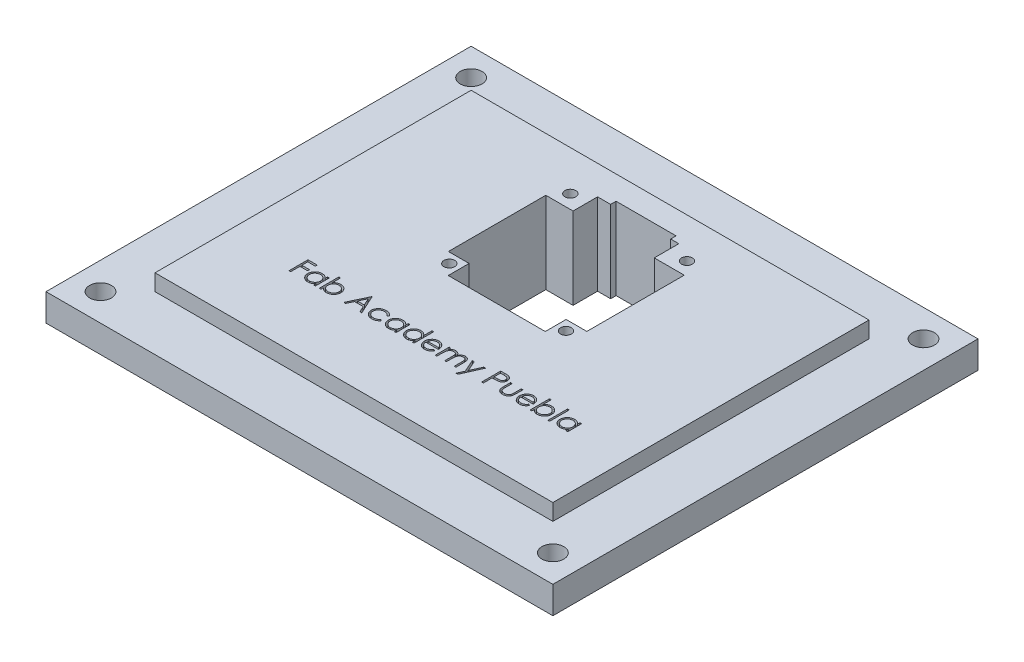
from build123d import *

# Parameters (mm, degrees)
SKETCH2_W           = 73
SKETCH2_H           = 58
SKETCH2_W_2         = 25.4
SKETCH2_H_2         = 26.2
BOSS_EXTRUDE1_DEPTH = 15
SKETCH3_W           = 5
SKETCH3_H           = 4.5
SKETCH3_W_2         = 5.5
SKETCH3_W_3         = 3.8
SKETCH3_H_2         = 3.828755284
BOSS_EXTRUDE2_DEPTH = 15
SKETCH4_R           = 1
SKETCH4_W           = 11
SKETCH4_H           = 1
CUT_EXTRUDE1_DEPTH  = 49.971930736
SKETCH6_W           = 93
SKETCH6_H           = 78
SKETCH6_R           = 2
SKETCH6_W_2         = 73
SKETCH6_H_2         = 58
BOSS_EXTRUDE6_DEPTH = 5
SKETCH7_W           = 0.314102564
SKETCH7_H           = 3.58974359
CUT_EXTRUDE2_DEPTH  = 2


with BuildPart() as part:
    # Sketch2 → Boss-Extrude1 (new body)
    with BuildSketch(Plane(origin=(0, 0, 0), x_dir=(1, 0, 0), z_dir=(0, 1, 0))):
        Rectangle(SKETCH2_W, SKETCH2_H)
        with Locations((-0.26899571, 10.570280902)):
            Rectangle(SKETCH2_W_2, SKETCH2_H_2, mode=Mode.SUBTRACT)
    extrude(amount=BOSS_EXTRUDE1_DEPTH)

    # Sketch3 → Boss-Extrude2 (add)
    with BuildSketch(Plane(origin=(0, 15, 0), x_dir=(1, 0, 0), z_dir=(0, 1, 0))):
        with Locations((-10.46899571, 21.420280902)):
            Rectangle(SKETCH3_W, SKETCH3_H)
        with Locations((9.68100429, 21.420280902)):
            Rectangle(SKETCH3_W_2, SKETCH3_H)
        with Locations((10.53100429, -0.615341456)):
            Rectangle(SKETCH3_W_3, SKETCH3_H_2)
        with Locations((-11.06899571, -0.615341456)):
            Rectangle(SKETCH3_W_3, SKETCH3_H_2)
    extrude(amount=-BOSS_EXTRUDE2_DEPTH)

    # Sketch4 → Cut-Extrude1 (cut, through all)
    with BuildSketch(Plane(origin=(0, 15, 0), x_dir=(1, 0, 0), z_dir=(0, 1, 0))):
        with Locations(Location((-10.96899571, 21.670280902, 0), (0, 0, 270))):
            Circle(SKETCH4_R)
        with Locations(Location((10.43100429, 21.670280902, 0), (0, 0, 270))):
            Circle(SKETCH4_R)
        with Locations(Location((-10.96899571, -0.529719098, 0), (0, 0, 270))):
            Circle(SKETCH4_R)
        with Locations(Location((10.43100429, -0.529719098, 0), (0, 0, 270))):
            Circle(SKETCH4_R)
        with Locations((-0.06899571, 24.170280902)):
            Rectangle(SKETCH4_W, SKETCH4_H)
    extrude(amount=-CUT_EXTRUDE1_DEPTH, mode=Mode.SUBTRACT)

    # Sketch6 → Boss-Extrude6 (add)
    with BuildSketch(Plane(origin=(0, 12, 0), x_dir=(1, 0, 0), z_dir=(0, 1, 0))):
        Rectangle(SKETCH6_W, SKETCH6_H)
        with Locations(Location((41.5, 34, 0), (0, 0, 270))):
            Circle(SKETCH6_R, mode=Mode.SUBTRACT)
        with Locations(Location((41.5, -34, 0), (0, 0, 270))):
            Circle(SKETCH6_R, mode=Mode.SUBTRACT)
        with Locations(Location((-41.5, -34, 0), (0, 0, 270))):
            Circle(SKETCH6_R, mode=Mode.SUBTRACT)
        with Locations(Location((-41.5, 34, 0), (0, 0, 270))):
            Circle(SKETCH6_R, mode=Mode.SUBTRACT)
        Rectangle(SKETCH6_W_2, SKETCH6_H_2, mode=Mode.SUBTRACT)
    extrude(amount=-BOSS_EXTRUDE6_DEPTH)

    # Sketch7 → Cut-Extrude2 (cut)
    # profile 1 of 16: a face of its own
    with BuildSketch(Plane(origin=(0, 15, 0), x_dir=(1, 0, 0), z_dir=(0, 1, 0))):
        Polygon((-24.535377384, -12.892726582), (-22.830249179, -12.892726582), (-22.830249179, -13.251700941), (-24.22127482, -13.251700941), (-24.22127482, -14.328624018), (-22.830249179, -14.328624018), (-22.830249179, -14.687598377), (-24.22127482, -14.687598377), (-24.22127482, -16.392726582), (-24.535377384, -16.392726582), align=None)
    # profile 2 of 16: a face of its own
    with BuildSketch(Plane(origin=(0, 15, 0), x_dir=(1, 0, 0), z_dir=(0, 1, 0))):
        with BuildLine():
            Line((-19.689223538, -13.835034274), (-19.689223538, -16.392726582))
            Line((-19.689223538, -16.392726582), (-20.003326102, -16.392726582))
            Line((-20.003326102, -16.392726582), (-20.003326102, -15.95031873))
            add(Edge.make_bspline(
                [(-20.003326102, -15.95031873), (-20.038744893, -15.990358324), (-20.107865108, -16.068496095), (-20.223306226, -16.170578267), (-20.345674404, -16.254956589), (-20.474375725, -16.323106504), (-20.609293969, -16.374298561), (-20.750130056, -16.41068472), (-20.896941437, -16.434078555), (-20.997193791, -16.436414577), (-21.047997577, -16.437598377)],
                knots=[0, 0, 0, 0, 1.074387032, 2.096679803, 3.090159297, 4.057316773, 5.018401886, 5.985159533, 6.978961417, 8, 8, 8, 8], degree=3))
            add(Edge.make_bspline(
                [(-21.047997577, -16.437598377), (-21.09316553, -16.436372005), (-21.182238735, -16.433953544), (-21.313267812, -16.415191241), (-21.439360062, -16.385060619), (-21.560634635, -16.34315973), (-21.67630678, -16.287578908), (-21.787366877, -16.22103766), (-21.893239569, -16.14179683), (-21.992311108, -16.051208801), (-22.083543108, -15.952813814), (-22.163604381, -15.847868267), (-22.230357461, -15.736825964), (-22.286177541, -15.62109281), (-22.329173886, -15.49977789), (-22.35914752, -15.373300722), (-22.377887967, -15.241810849), (-22.380305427, -15.152271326), (-22.38153123, -15.10686921)],
                knots=[0, 0, 0, 0, 1.033919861, 2.038935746, 3.024066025, 3.998881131, 4.97069526, 5.957263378, 6.95902576, 7.993208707, 9.027059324, 10.027763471, 11.009749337, 11.988697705, 12.965288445, 13.950418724, 14.960734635, 16, 16, 16, 16], degree=3))
            add(Edge.make_bspline(
                [(-22.38153123, -15.10686921), (-22.380278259, -15.062405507), (-22.377801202, -14.974503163), (-22.359347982, -14.845224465), (-22.328316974, -14.720706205), (-22.284769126, -14.601349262), (-22.228927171, -14.487009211), (-22.160999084, -14.377605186), (-22.080979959, -14.272835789), (-21.988727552, -14.175164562), (-21.888792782, -14.084943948), (-21.781884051, -14.006534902), (-21.67066077, -13.938818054), (-21.553397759, -13.885164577), (-21.431830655, -13.841755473), (-21.304877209, -13.811722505), (-21.17306563, -13.794025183), (-21.083575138, -13.791462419), (-21.038181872, -13.79016248)],
                knots=[0, 0, 0, 0, 1.020392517, 2.01726096, 2.990465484, 3.961182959, 4.928053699, 5.906110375, 6.912531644, 7.948652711, 8.985773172, 9.998621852, 10.987621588, 11.969261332, 12.953316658, 13.946091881, 14.958173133, 16, 16, 16, 16], degree=3))
            add(Edge.make_bspline(
                [(-21.038181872, -13.79016248), (-20.985982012, -13.791600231), (-20.883620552, -13.794419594), (-20.733892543, -13.817882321), (-20.592248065, -13.857520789), (-20.457593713, -13.911438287), (-20.330413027, -13.983087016), (-20.211910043, -14.073466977), (-20.10084456, -14.182008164), (-20.036464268, -14.265378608), (-20.003326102, -14.308291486)],
                knots=[0, 0, 0, 0, 1.038897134, 2.037228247, 3.008116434, 3.962042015, 4.918381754, 5.904844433, 6.921570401, 8, 8, 8, 8], degree=3))
            Line((-20.003326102, -14.308291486), (-20.003326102, -13.835034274))
            Line((-20.003326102, -13.835034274), (-19.689223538, -13.835034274))
        make_face()
        with BuildLine():
            add(Edge.make_bspline(
                [(-21.033975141, -14.104265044), (-21.079889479, -14.105898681), (-21.170517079, -14.109123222), (-21.303561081, -14.134296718), (-21.430874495, -14.176181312), (-21.551820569, -14.233463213), (-21.664488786, -14.30549195), (-21.765182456, -14.392613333), (-21.854725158, -14.492450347), (-21.930033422, -14.604552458), (-21.991423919, -14.724730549), (-22.034590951, -14.850354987), (-22.063060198, -14.979159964), (-22.065968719, -15.06652265), (-22.067428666, -15.110374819)],
                knots=[0, 0, 0, 0, 1.031046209, 2.035121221, 3.029706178, 4.034933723, 5.034054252, 6.02443088, 7.017295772, 8.038157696, 9.050218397, 10.03989886, 11.016116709, 12, 12, 12, 12], degree=3))
            add(Edge.make_bspline(
                [(-22.067428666, -15.110374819), (-22.065563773, -15.153964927), (-22.061841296, -15.240974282), (-22.035090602, -15.369954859), (-21.990210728, -15.495608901), (-21.928968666, -15.616869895), (-21.852282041, -15.729453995), (-21.763393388, -15.831194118), (-21.661443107, -15.918683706), (-21.5485156, -15.99192128), (-21.42790763, -16.0510838), (-21.301073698, -16.09224944), (-21.17039806, -16.118827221), (-21.081545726, -16.121931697), (-21.036779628, -16.123495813)],
                knots=[0, 0, 0, 0, 0.979072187, 1.954306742, 2.945804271, 3.96968567, 4.997920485, 5.998718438, 6.996577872, 8.005894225, 9.015743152, 10.005417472, 10.995077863, 12, 12, 12, 12], degree=3))
            add(Edge.make_bspline(
                [(-21.036779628, -16.123495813), (-20.991333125, -16.121835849), (-20.900944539, -16.118534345), (-20.767505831, -16.09325308), (-20.638010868, -16.051484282), (-20.51422364, -15.993585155), (-20.398907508, -15.921827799), (-20.295409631, -15.837820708), (-20.207893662, -15.740117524), (-20.133701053, -15.632741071), (-20.075525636, -15.515029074), (-20.033149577, -15.389694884), (-20.008095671, -15.256734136), (-20.004937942, -15.165870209), (-20.003326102, -15.119489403)],
                knots=[0, 0, 0, 0, 1.01762866, 2.023962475, 3.030623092, 4.058876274, 5.077231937, 6.066672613, 7.034107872, 8.005628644, 8.981990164, 9.965428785, 10.961468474, 12, 12, 12, 12], degree=3))
            add(Edge.make_bspline(
                [(-20.003326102, -15.119489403), (-20.004285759, -15.084151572), (-20.006174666, -15.014595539), (-20.020605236, -14.912468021), (-20.043560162, -14.814734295), (-20.075906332, -14.721291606), (-20.118397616, -14.632656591), (-20.169645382, -14.548192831), (-20.230550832, -14.468339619), (-20.300133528, -14.394196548), (-20.376298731, -14.326570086), (-20.456893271, -14.266205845), (-20.542872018, -14.216617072), (-20.632789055, -14.175575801), (-20.72680039, -14.142916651), (-20.82567101, -14.121128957), (-20.928349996, -14.106168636), (-20.998396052, -14.104906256), (-21.033975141, -14.104265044)],
                knots=[0, 0, 0, 0, 1.050140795, 2.067009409, 3.05949893, 4.030605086, 5.00011959, 5.97591094, 6.962425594, 7.979863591, 8.993523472, 9.986985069, 10.967611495, 11.937549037, 12.921786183, 13.919465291, 14.943216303, 16, 16, 16, 16], degree=3))
        make_face(mode=Mode.SUBTRACT)
    # profile 3 of 16: a face of its own
    with BuildSketch(Plane(origin=(0, 15, 0), x_dir=(1, 0, 0), z_dir=(0, 1, 0))):
        with BuildLine():
            Line((-18.97127482, -16.392726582), (-18.97127482, -12.802982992))
            Line((-18.97127482, -12.802982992), (-18.657172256, -12.802982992))
            Line((-18.657172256, -12.802982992), (-18.657172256, -14.299176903))
            add(Edge.make_bspline(
                [(-18.657172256, -14.299176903), (-18.621778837, -14.258418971), (-18.552724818, -14.178898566), (-18.436948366, -14.075050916), (-18.315542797, -13.986998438), (-18.187584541, -13.91441232), (-18.052891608, -13.859138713), (-17.912159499, -13.818716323), (-17.765028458, -13.79432942), (-17.664709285, -13.791563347), (-17.613903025, -13.79016248)],
                knots=[0, 0, 0, 0, 1.077089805, 2.101446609, 3.097517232, 4.067117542, 5.031729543, 5.997785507, 6.985986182, 8, 8, 8, 8], degree=3))
            add(Edge.make_bspline(
                [(-17.613903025, -13.79016248), (-17.568736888, -13.791402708), (-17.479435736, -13.79385485), (-17.348153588, -13.812489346), (-17.221840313, -13.842707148), (-17.100564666, -13.884599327), (-16.984892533, -13.940182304), (-16.873833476, -14.006723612), (-16.767956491, -14.085961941), (-16.668901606, -14.176560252), (-16.57760772, -14.274916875), (-16.49769521, -14.38009719), (-16.430195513, -14.49057228), (-16.374364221, -14.605972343), (-16.331193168, -14.726768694), (-16.301450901, -14.852842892), (-16.282557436, -14.984070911), (-16.28017719, -15.073383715), (-16.278967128, -15.118788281)],
                knots=[0, 0, 0, 0, 1.034377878, 2.045141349, 3.03070803, 4.00595497, 4.978199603, 5.965204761, 6.967410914, 8.002051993, 9.036360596, 10.037508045, 11.022711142, 11.997267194, 12.969246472, 13.954813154, 14.960274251, 16, 16, 16, 16], degree=3))
            add(Edge.make_bspline(
                [(-16.278967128, -15.118788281), (-16.280203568, -15.163488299), (-16.282641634, -15.251629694), (-16.301262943, -15.38133625), (-16.332009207, -15.506174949), (-16.375970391, -15.625823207), (-16.431235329, -15.74084312), (-16.500346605, -15.849923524), (-16.580157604, -15.9549625), (-16.672488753, -16.052586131), (-16.772402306, -16.142819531), (-16.879316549, -16.221225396), (-16.99053847, -16.288942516), (-17.107801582, -16.342597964), (-17.229369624, -16.385998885), (-17.356545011, -16.416116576), (-17.488608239, -16.433689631), (-17.578327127, -16.436285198), (-17.62371873, -16.437598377)],
                knots=[0, 0, 0, 0, 1.024244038, 2.01964794, 2.996620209, 3.965911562, 4.936179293, 5.91563013, 6.920572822, 7.955171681, 8.990768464, 10.002129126, 10.989675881, 11.969873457, 12.952483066, 13.943799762, 14.959703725, 16, 16, 16, 16], degree=3))
            add(Edge.make_bspline(
                [(-17.62371873, -16.437598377), (-17.675683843, -16.436157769), (-17.777578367, -16.433332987), (-17.926631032, -16.409914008), (-18.067712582, -16.370052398), (-18.20243013, -16.316490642), (-18.328857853, -16.243961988), (-18.447798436, -16.154005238), (-18.558501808, -16.045138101), (-18.623718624, -15.962076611), (-18.657172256, -15.919469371)],
                knots=[0, 0, 0, 0, 1.035807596, 2.031038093, 2.998900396, 3.954262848, 4.914341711, 5.895762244, 6.92060972, 8, 8, 8, 8], degree=3))
            Line((-18.657172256, -15.919469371), (-18.657172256, -16.392726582))
            Line((-18.657172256, -16.392726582), (-18.97127482, -16.392726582))
        make_face()
        with BuildLine():
            add(Edge.make_bspline(
                [(-17.626523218, -16.123495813), (-17.580608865, -16.121862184), (-17.489981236, -16.11863766), (-17.356937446, -16.093464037), (-17.229623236, -16.051579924), (-17.108680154, -15.994296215), (-16.996000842, -15.92227418), (-16.895348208, -15.83512801), (-16.805868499, -15.735626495), (-16.731216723, -15.623392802), (-16.668890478, -15.503941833), (-16.626077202, -15.378287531), (-16.597357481, -15.249792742), (-16.594505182, -15.162646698), (-16.593069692, -15.118788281)],
                knots=[0, 0, 0, 0, 1.031910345, 2.036826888, 3.032245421, 4.038315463, 5.03827337, 6.029480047, 7.023177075, 8.037597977, 9.052889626, 10.043399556, 11.015292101, 12, 12, 12, 12], degree=3))
            add(Edge.make_bspline(
                [(-16.593069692, -15.118788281), (-16.594957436, -15.074972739), (-16.598725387, -14.987516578), (-16.62510017, -14.857866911), (-16.67115796, -14.732279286), (-16.732275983, -14.611101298), (-16.808143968, -14.498093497), (-16.897149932, -14.39660337), (-16.999031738, -14.309043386), (-17.111855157, -14.236053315), (-17.232035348, -14.176493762), (-17.358525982, -14.135648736), (-17.488684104, -14.108910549), (-17.577079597, -14.105821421), (-17.621615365, -14.104265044)],
                knots=[0, 0, 0, 0, 0.984795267, 1.965658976, 2.959410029, 3.983795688, 5.009594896, 6.01088574, 7.009236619, 8.019050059, 9.024672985, 10.014834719, 10.999826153, 12, 12, 12, 12], degree=3))
            add(Edge.make_bspline(
                [(-17.621615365, -14.104265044), (-17.667082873, -14.105820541), (-17.757326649, -14.108907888), (-17.890494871, -14.135695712), (-18.020558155, -14.176743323), (-18.144845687, -14.235674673), (-18.260699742, -14.307786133), (-18.364312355, -14.392526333), (-18.453643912, -14.489306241), (-18.527187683, -14.597812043), (-18.585592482, -14.714997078), (-18.62737623, -14.840009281), (-18.652375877, -14.972190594), (-18.655554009, -15.0628238), (-18.657172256, -15.108972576)],
                knots=[0, 0, 0, 0, 1.016820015, 2.018181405, 3.029022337, 4.06341356, 5.088169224, 6.076823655, 7.05054209, 8.02560866, 9.001194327, 9.972267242, 10.967515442, 12, 12, 12, 12], degree=3))
            add(Edge.make_bspline(
                [(-18.657172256, -15.108972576), (-18.656212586, -15.144310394), (-18.654323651, -15.213866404), (-18.639893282, -15.315994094), (-18.61693762, -15.413727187), (-18.584594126, -15.507172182), (-18.542092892, -15.595798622), (-18.490882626, -15.680294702), (-18.429930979, -15.75989798), (-18.36102439, -15.834413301), (-18.285062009, -15.902222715), (-18.203538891, -15.96100094), (-18.11812096, -16.01161513), (-18.027830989, -16.051959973), (-17.933719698, -16.084886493), (-17.834821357, -16.106620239), (-17.732149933, -16.121595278), (-17.662102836, -16.122855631), (-17.626523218, -16.123495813)],
                knots=[0, 0, 0, 0, 1.050331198, 2.067384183, 3.060053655, 4.031335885, 5.001026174, 5.976994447, 6.963687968, 7.976578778, 8.990422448, 9.985569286, 10.960374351, 11.936812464, 12.921228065, 13.919088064, 14.943024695, 16, 16, 16, 16], degree=3))
        make_face(mode=Mode.SUBTRACT)
    # profile 4 of 16: a face of its own
    with BuildSketch(Plane(origin=(0, 15, 0), x_dir=(1, 0, 0), z_dir=(0, 1, 0))):
        Polygon((-12.778967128, -12.892726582), (-11.163582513, -16.392726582), (-11.505028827, -16.392726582), (-12.022456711, -15.27093171), (-13.609095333, -15.27093171), (-14.141246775, -16.392726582), (-14.484095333, -16.392726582), (-12.823838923, -12.892726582), align=None)
        Polygon((-12.804908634, -13.574918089), (-13.438722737, -14.911957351), (-12.187921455, -14.911957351), align=None, mode=Mode.SUBTRACT)
    # profile 5 of 16: a face of its own
    with BuildSketch(Plane(origin=(0, 15, 0), x_dir=(1, 0, 0), z_dir=(0, 1, 0))):
        with BuildLine():
            Line((-8.112300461, -14.389621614), (-8.375221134, -14.552982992))
            add(Edge.make_bspline(
                [(-8.375221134, -14.552982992), (-8.404051, -14.517154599), (-8.460797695, -14.446632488), (-8.559336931, -14.355622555), (-8.664348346, -14.277455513), (-8.777626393, -14.213751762), (-8.899012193, -14.164530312), (-9.028027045, -14.129700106), (-9.164652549, -14.107995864), (-9.258317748, -14.105529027), (-9.306310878, -14.104265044)],
                knots=[0, 0, 0, 0, 1.026593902, 2.0206758, 2.988051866, 3.946915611, 4.916868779, 5.907761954, 6.927957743, 8, 8, 8, 8], degree=3))
            add(Edge.make_bspline(
                [(-9.306310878, -14.104265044), (-9.344669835, -14.105321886), (-9.420216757, -14.107403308), (-9.531122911, -14.120413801), (-9.636765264, -14.14405581), (-9.737805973, -14.175206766), (-9.833526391, -14.216957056), (-9.92417731, -14.267766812), (-10.0105628, -14.326816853), (-10.090179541, -14.395227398), (-10.163008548, -14.469626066), (-10.226107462, -14.549379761), (-10.281044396, -14.632099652), (-10.324150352, -14.719851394), (-10.359425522, -14.810627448), (-10.382632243, -14.906141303), (-10.398096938, -15.005169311), (-10.399866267, -15.072687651), (-10.400762, -15.10686921)],
                knots=[0, 0, 0, 0, 1.112346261, 2.190735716, 3.231507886, 4.247384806, 5.251966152, 6.253067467, 7.256802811, 8.280671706, 9.291813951, 10.270744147, 11.225547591, 12.165006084, 13.100104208, 14.043489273, 15.009504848, 16, 16, 16, 16], degree=3))
            add(Edge.make_bspline(
                [(-10.400762, -15.10686921), (-10.398982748, -15.151638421), (-10.395448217, -15.240573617), (-10.367746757, -15.371851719), (-10.32240235, -15.498775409), (-10.260344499, -15.620443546), (-10.181867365, -15.733037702), (-10.089694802, -15.834021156), (-9.983775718, -15.921437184), (-9.865043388, -15.993909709), (-9.736285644, -16.052171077), (-9.598895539, -16.09367841), (-9.453995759, -16.118730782), (-9.354789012, -16.121886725), (-9.304207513, -16.123495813)],
                knots=[0, 0, 0, 0, 0.966302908, 1.919585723, 2.883856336, 3.870342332, 4.860282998, 5.839159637, 6.814385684, 7.815993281, 8.834850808, 9.858348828, 10.908058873, 12, 12, 12, 12], degree=3))
            add(Edge.make_bspline(
                [(-9.304207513, -16.123495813), (-9.257852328, -16.122196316), (-9.16675209, -16.119642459), (-9.033584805, -16.098113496), (-8.906804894, -16.062869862), (-8.786416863, -16.013722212), (-8.672640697, -15.950194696), (-8.566211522, -15.871835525), (-8.465011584, -15.780898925), (-8.405514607, -15.710580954), (-8.375221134, -15.674777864)],
                knots=[0, 0, 0, 0, 1.039848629, 2.043578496, 3.018386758, 3.987534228, 4.954977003, 5.934852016, 6.948509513, 8, 8, 8, 8], degree=3))
            Line((-8.375221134, -15.674777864), (-8.112300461, -15.847253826))
            add(Edge.make_bspline(
                [(-8.112300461, -15.847253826), (-8.127888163, -15.870144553), (-8.15901183, -15.915850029), (-8.211039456, -15.980294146), (-8.267159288, -16.040615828), (-8.327152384, -16.096734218), (-8.390235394, -16.149992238), (-8.458563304, -16.197843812), (-8.529932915, -16.242978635), (-8.605182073, -16.283591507), (-8.683532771, -16.320097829), (-8.764874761, -16.351488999), (-8.848854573, -16.378459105), (-8.93557095, -16.399896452), (-9.025194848, -16.41700729), (-9.117494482, -16.428360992), (-9.212438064, -16.436836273), (-9.276610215, -16.43734214), (-9.309115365, -16.437598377)],
                knots=[0, 0, 0, 0, 0.954134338, 1.905101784, 2.851144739, 3.791306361, 4.734911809, 5.6936923, 6.663572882, 7.643865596, 8.638447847, 9.640600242, 10.646758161, 11.676244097, 12.717260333, 13.78922464, 14.880174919, 16, 16, 16, 16], degree=3))
            add(Edge.make_bspline(
                [(-9.309115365, -16.437598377), (-9.358726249, -16.436707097), (-9.455963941, -16.434960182), (-9.598286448, -16.415751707), (-9.734300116, -16.386794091), (-9.863958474, -16.345230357), (-9.987281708, -16.291725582), (-10.104154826, -16.226368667), (-10.214190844, -16.148616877), (-10.316301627, -16.059854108), (-10.410083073, -15.963613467), (-10.490609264, -15.859763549), (-10.560454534, -15.752122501), (-10.616542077, -15.638312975), (-10.661189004, -15.519847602), (-10.691693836, -15.395777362), (-10.711423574, -15.267125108), (-10.713706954, -15.179392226), (-10.714864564, -15.134914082)],
                knots=[0, 0, 0, 0, 1.1129367, 2.181364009, 3.217532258, 4.231199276, 5.232079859, 6.230262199, 7.231623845, 8.250719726, 9.263571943, 10.242672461, 11.195837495, 12.138959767, 13.085126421, 14.0317438, 15.002148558, 16, 16, 16, 16], degree=3))
            add(Edge.make_bspline(
                [(-10.714864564, -15.134914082), (-10.714423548, -15.104735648), (-10.713546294, -15.04470576), (-10.703484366, -14.955610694), (-10.690485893, -14.867702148), (-10.668460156, -14.782094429), (-10.643019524, -14.697489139), (-10.610543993, -14.614906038), (-10.572448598, -14.533961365), (-10.52919665, -14.454863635), (-10.480507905, -14.378914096), (-10.426626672, -14.307160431), (-10.369582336, -14.238740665), (-10.306706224, -14.176016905), (-10.24066657, -14.116480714), (-10.169594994, -14.061722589), (-10.093899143, -14.011581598), (-10.01471582, -13.965130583), (-9.932091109, -13.923771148), (-9.846524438, -13.88813791), (-9.758531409, -13.857685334), (-9.667971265, -13.833576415), (-9.575445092, -13.813358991), (-9.480223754, -13.800641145), (-9.382671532, -13.791654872), (-9.316615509, -13.79066408), (-9.283173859, -13.79016248)],
                knots=[0, 0, 0, 0, 0.990994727, 1.971252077, 2.943264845, 3.907940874, 4.872158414, 5.844625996, 6.82015047, 7.809835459, 8.804511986, 9.781214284, 10.756496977, 11.728388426, 12.696359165, 13.676225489, 14.672885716, 15.677705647, 16.690706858, 17.706033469, 18.721040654, 19.747369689, 20.783475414, 21.830280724, 22.901553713, 24, 24, 24, 24], degree=3))
            add(Edge.make_bspline(
                [(-9.283173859, -13.79016248), (-9.241293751, -13.791084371), (-9.157742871, -13.792923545), (-9.033802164, -13.808402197), (-8.91168697, -13.831738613), (-8.793539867, -13.866311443), (-8.680793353, -13.908175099), (-8.575257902, -13.955187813), (-8.479417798, -14.009782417), (-8.391490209, -14.069502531), (-8.311310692, -14.136863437), (-8.238056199, -14.212670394), (-8.17022455, -14.296528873), (-8.131767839, -14.358334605), (-8.112300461, -14.389621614)],
                knots=[0, 0, 0, 0, 1.095225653, 2.184976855, 3.262915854, 4.344593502, 5.400796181, 6.407717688, 7.363229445, 8.282371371, 9.184954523, 10.097238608, 11.036792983, 12, 12, 12, 12], degree=3))
        make_face()
    # profile 6 of 16: a face of its own
    with BuildSketch(Plane(origin=(0, 15, 0), x_dir=(1, 0, 0), z_dir=(0, 1, 0))):
        with BuildLine():
            Line((-4.88153123, -13.835034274), (-4.88153123, -16.392726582))
            Line((-4.88153123, -16.392726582), (-5.195633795, -16.392726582))
            Line((-5.195633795, -16.392726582), (-5.195633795, -15.95031873))
            add(Edge.make_bspline(
                [(-5.195633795, -15.95031873), (-5.231052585, -15.990358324), (-5.3001728, -16.068496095), (-5.415613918, -16.170578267), (-5.537982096, -16.254956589), (-5.666683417, -16.323106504), (-5.801601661, -16.374298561), (-5.942437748, -16.41068472), (-6.089249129, -16.434078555), (-6.189501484, -16.436414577), (-6.240305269, -16.437598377)],
                knots=[0, 0, 0, 0, 1.074387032, 2.096679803, 3.090159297, 4.057316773, 5.018401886, 5.985159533, 6.978961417, 8, 8, 8, 8], degree=3))
            add(Edge.make_bspline(
                [(-6.240305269, -16.437598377), (-6.285473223, -16.436372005), (-6.374546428, -16.433953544), (-6.505575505, -16.415191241), (-6.631667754, -16.385060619), (-6.752942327, -16.34315973), (-6.868614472, -16.287578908), (-6.979674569, -16.22103766), (-7.085547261, -16.14179683), (-7.1846188, -16.051208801), (-7.2758508, -15.952813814), (-7.355912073, -15.847868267), (-7.422665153, -15.736825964), (-7.478485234, -15.62109281), (-7.521481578, -15.49977789), (-7.551455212, -15.373300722), (-7.570195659, -15.241810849), (-7.57261312, -15.152271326), (-7.573838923, -15.10686921)],
                knots=[0, 0, 0, 0, 1.033919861, 2.038935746, 3.024066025, 3.998881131, 4.97069526, 5.957263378, 6.95902576, 7.993208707, 9.027059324, 10.027763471, 11.009749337, 11.988697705, 12.965288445, 13.950418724, 14.960734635, 16, 16, 16, 16], degree=3))
            add(Edge.make_bspline(
                [(-7.573838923, -15.10686921), (-7.572585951, -15.062405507), (-7.570108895, -14.974503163), (-7.551655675, -14.845224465), (-7.520624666, -14.720706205), (-7.477076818, -14.601349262), (-7.421234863, -14.487009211), (-7.353306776, -14.377605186), (-7.273287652, -14.272835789), (-7.181035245, -14.175164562), (-7.081100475, -14.084943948), (-6.974191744, -14.006534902), (-6.862968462, -13.938818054), (-6.745705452, -13.885164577), (-6.624138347, -13.841755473), (-6.497184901, -13.811722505), (-6.365373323, -13.794025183), (-6.27588283, -13.791462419), (-6.230489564, -13.79016248)],
                knots=[0, 0, 0, 0, 1.020392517, 2.01726096, 2.990465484, 3.961182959, 4.928053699, 5.906110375, 6.912531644, 7.948652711, 8.985773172, 9.998621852, 10.987621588, 11.969261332, 12.953316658, 13.946091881, 14.958173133, 16, 16, 16, 16], degree=3))
            add(Edge.make_bspline(
                [(-6.230489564, -13.79016248), (-6.178289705, -13.791600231), (-6.075928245, -13.794419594), (-5.926200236, -13.817882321), (-5.784555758, -13.857520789), (-5.649901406, -13.911438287), (-5.522720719, -13.983087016), (-5.404217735, -14.073466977), (-5.293152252, -14.182008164), (-5.22877196, -14.265378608), (-5.195633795, -14.308291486)],
                knots=[0, 0, 0, 0, 1.038897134, 2.037228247, 3.008116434, 3.962042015, 4.918381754, 5.904844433, 6.921570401, 8, 8, 8, 8], degree=3))
            Line((-5.195633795, -14.308291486), (-5.195633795, -13.835034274))
            Line((-5.195633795, -13.835034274), (-4.88153123, -13.835034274))
        make_face()
        with BuildLine():
            add(Edge.make_bspline(
                [(-6.226282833, -14.104265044), (-6.272197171, -14.105898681), (-6.362824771, -14.109123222), (-6.495868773, -14.134296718), (-6.623182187, -14.176181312), (-6.744128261, -14.233463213), (-6.856796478, -14.30549195), (-6.957490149, -14.392613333), (-7.04703285, -14.492450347), (-7.122341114, -14.604552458), (-7.183731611, -14.724730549), (-7.226898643, -14.850354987), (-7.255367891, -14.979159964), (-7.258276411, -15.06652265), (-7.259736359, -15.110374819)],
                knots=[0, 0, 0, 0, 1.031046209, 2.035121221, 3.029706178, 4.034933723, 5.034054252, 6.02443088, 7.017295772, 8.038157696, 9.050218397, 10.03989886, 11.016116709, 12, 12, 12, 12], degree=3))
            add(Edge.make_bspline(
                [(-7.259736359, -15.110374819), (-7.257871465, -15.153964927), (-7.254148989, -15.240974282), (-7.227398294, -15.369954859), (-7.182518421, -15.495608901), (-7.121276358, -15.616869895), (-7.044589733, -15.729453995), (-6.955701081, -15.831194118), (-6.853750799, -15.918683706), (-6.740823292, -15.99192128), (-6.620215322, -16.0510838), (-6.49338139, -16.09224944), (-6.362705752, -16.118827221), (-6.273853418, -16.121931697), (-6.22908732, -16.123495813)],
                knots=[0, 0, 0, 0, 0.979072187, 1.954306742, 2.945804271, 3.96968567, 4.997920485, 5.998718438, 6.996577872, 8.005894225, 9.015743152, 10.005417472, 10.995077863, 12, 12, 12, 12], degree=3))
            add(Edge.make_bspline(
                [(-6.22908732, -16.123495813), (-6.183640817, -16.121835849), (-6.093252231, -16.118534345), (-5.959813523, -16.09325308), (-5.83031856, -16.051484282), (-5.706531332, -15.993585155), (-5.591215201, -15.921827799), (-5.487717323, -15.837820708), (-5.400201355, -15.740117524), (-5.326008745, -15.632741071), (-5.267833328, -15.515029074), (-5.225457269, -15.389694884), (-5.200403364, -15.256734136), (-5.197245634, -15.165870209), (-5.195633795, -15.119489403)],
                knots=[0, 0, 0, 0, 1.01762866, 2.023962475, 3.030623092, 4.058876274, 5.077231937, 6.066672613, 7.034107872, 8.005628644, 8.981990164, 9.965428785, 10.961468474, 12, 12, 12, 12], degree=3))
            add(Edge.make_bspline(
                [(-5.195633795, -15.119489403), (-5.196593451, -15.084151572), (-5.198482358, -15.014595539), (-5.212912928, -14.912468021), (-5.235867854, -14.814734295), (-5.268214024, -14.721291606), (-5.310705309, -14.632656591), (-5.361953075, -14.548192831), (-5.422858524, -14.468339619), (-5.49244122, -14.394196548), (-5.568606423, -14.326570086), (-5.649200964, -14.266205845), (-5.735179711, -14.216617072), (-5.825096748, -14.175575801), (-5.919108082, -14.142916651), (-6.017978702, -14.121128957), (-6.120657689, -14.106168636), (-6.190703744, -14.104906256), (-6.226282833, -14.104265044)],
                knots=[0, 0, 0, 0, 1.050140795, 2.067009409, 3.05949893, 4.030605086, 5.00011959, 5.97591094, 6.962425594, 7.979863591, 8.993523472, 9.986985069, 10.967611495, 11.937549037, 12.921786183, 13.919465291, 14.943216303, 16, 16, 16, 16], degree=3))
        make_face(mode=Mode.SUBTRACT)
    # profile 7 of 16: a face of its own
    with BuildSketch(Plane(origin=(0, 15, 0), x_dir=(1, 0, 0), z_dir=(0, 1, 0))):
        with BuildLine():
            Line((-1.56101841, -12.802982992), (-1.56101841, -16.392726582))
            Line((-1.56101841, -16.392726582), (-1.875120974, -16.392726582))
            Line((-1.875120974, -16.392726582), (-1.875120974, -15.95031873))
            add(Edge.make_bspline(
                [(-1.875120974, -15.95031873), (-1.910539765, -15.990358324), (-1.97965998, -16.068496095), (-2.095101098, -16.170578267), (-2.217469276, -16.254956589), (-2.346170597, -16.323106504), (-2.48108884, -16.374298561), (-2.621924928, -16.41068472), (-2.768736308, -16.434078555), (-2.868988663, -16.436414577), (-2.919792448, -16.437598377)],
                knots=[0, 0, 0, 0, 1.074387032, 2.096679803, 3.090159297, 4.057316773, 5.018401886, 5.985159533, 6.978961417, 8, 8, 8, 8], degree=3))
            add(Edge.make_bspline(
                [(-2.919792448, -16.437598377), (-2.964960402, -16.436372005), (-3.054033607, -16.433953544), (-3.185062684, -16.415191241), (-3.311154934, -16.385060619), (-3.432429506, -16.34315973), (-3.548101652, -16.287578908), (-3.659161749, -16.22103766), (-3.765034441, -16.14179683), (-3.864105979, -16.051208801), (-3.95533798, -15.952813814), (-4.035399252, -15.847868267), (-4.102152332, -15.736825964), (-4.157972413, -15.62109281), (-4.200968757, -15.49977789), (-4.230942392, -15.373300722), (-4.249682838, -15.241810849), (-4.252100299, -15.152271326), (-4.253326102, -15.10686921)],
                knots=[0, 0, 0, 0, 1.033919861, 2.038935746, 3.024066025, 3.998881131, 4.97069526, 5.957263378, 6.95902576, 7.993208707, 9.027059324, 10.027763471, 11.009749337, 11.988697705, 12.965288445, 13.950418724, 14.960734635, 16, 16, 16, 16], degree=3))
            add(Edge.make_bspline(
                [(-4.253326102, -15.10686921), (-4.252073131, -15.062405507), (-4.249596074, -14.974503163), (-4.231142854, -14.845224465), (-4.200111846, -14.720706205), (-4.156563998, -14.601349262), (-4.100722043, -14.487009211), (-4.032793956, -14.377605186), (-3.952774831, -14.272835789), (-3.860522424, -14.175164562), (-3.760587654, -14.084943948), (-3.653678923, -14.006534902), (-3.542455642, -13.938818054), (-3.425192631, -13.885164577), (-3.303625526, -13.841755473), (-3.176672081, -13.811722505), (-3.044860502, -13.794025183), (-2.95537001, -13.791462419), (-2.909976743, -13.79016248)],
                knots=[0, 0, 0, 0, 1.020392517, 2.01726096, 2.990465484, 3.961182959, 4.928053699, 5.906110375, 6.912531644, 7.948652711, 8.985773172, 9.998621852, 10.987621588, 11.969261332, 12.953316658, 13.946091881, 14.958173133, 16, 16, 16, 16], degree=3))
            add(Edge.make_bspline(
                [(-2.909976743, -13.79016248), (-2.857759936, -13.791729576), (-2.755264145, -13.794805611), (-2.605365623, -13.820511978), (-2.463578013, -13.863674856), (-2.329085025, -13.922766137), (-2.202688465, -13.999566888), (-2.083461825, -14.092318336), (-1.973478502, -14.203645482), (-1.908406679, -14.287257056), (-1.875120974, -14.330026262)],
                knots=[0, 0, 0, 0, 1.031072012, 2.023879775, 2.993683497, 3.952812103, 4.918022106, 5.908088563, 6.929940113, 8, 8, 8, 8], degree=3))
            Line((-1.875120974, -14.330026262), (-1.875120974, -12.802982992))
            Line((-1.875120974, -12.802982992), (-1.56101841, -12.802982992))
        make_face()
        with BuildLine():
            add(Edge.make_bspline(
                [(-2.905770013, -14.104265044), (-2.95168435, -14.105898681), (-3.04231195, -14.109123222), (-3.175355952, -14.134296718), (-3.302669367, -14.176181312), (-3.423615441, -14.233463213), (-3.536283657, -14.30549195), (-3.636977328, -14.392613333), (-3.72652003, -14.492450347), (-3.801828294, -14.604552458), (-3.863218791, -14.724730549), (-3.906385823, -14.850354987), (-3.93485507, -14.979159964), (-3.937763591, -15.06652265), (-3.939223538, -15.110374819)],
                knots=[0, 0, 0, 0, 1.031046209, 2.035121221, 3.029706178, 4.034933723, 5.034054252, 6.02443088, 7.017295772, 8.038157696, 9.050218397, 10.03989886, 11.016116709, 12, 12, 12, 12], degree=3))
            add(Edge.make_bspline(
                [(-3.939223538, -15.110374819), (-3.937358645, -15.153964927), (-3.933636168, -15.240974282), (-3.906885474, -15.369954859), (-3.8620056, -15.495608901), (-3.800763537, -15.616869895), (-3.724076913, -15.729453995), (-3.63518826, -15.831194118), (-3.533237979, -15.918683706), (-3.420310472, -15.99192128), (-3.299702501, -16.0510838), (-3.17286857, -16.09224944), (-3.042192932, -16.118827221), (-2.953340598, -16.121931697), (-2.9085745, -16.123495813)],
                knots=[0, 0, 0, 0, 0.979072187, 1.954306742, 2.945804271, 3.96968567, 4.997920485, 5.998718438, 6.996577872, 8.005894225, 9.015743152, 10.005417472, 10.995077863, 12, 12, 12, 12], degree=3))
            add(Edge.make_bspline(
                [(-2.9085745, -16.123495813), (-2.863127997, -16.121835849), (-2.77273941, -16.118534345), (-2.639300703, -16.09325308), (-2.50980574, -16.051484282), (-2.386018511, -15.993585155), (-2.27070238, -15.921827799), (-2.167204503, -15.837820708), (-2.079688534, -15.740117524), (-2.005495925, -15.632741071), (-1.947320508, -15.515029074), (-1.904944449, -15.389694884), (-1.879890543, -15.256734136), (-1.876732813, -15.165870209), (-1.875120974, -15.119489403)],
                knots=[0, 0, 0, 0, 1.01762866, 2.023962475, 3.030623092, 4.058876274, 5.077231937, 6.066672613, 7.034107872, 8.005628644, 8.981990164, 9.965428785, 10.961468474, 12, 12, 12, 12], degree=3))
            add(Edge.make_bspline(
                [(-1.875120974, -15.119489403), (-1.87608063, -15.084151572), (-1.877969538, -15.014595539), (-1.892400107, -14.912468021), (-1.915355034, -14.814734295), (-1.947701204, -14.721291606), (-1.990192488, -14.632656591), (-2.041440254, -14.548192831), (-2.102345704, -14.468339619), (-2.1719284, -14.394196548), (-2.248093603, -14.326570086), (-2.328688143, -14.266205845), (-2.41466689, -14.216617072), (-2.504583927, -14.175575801), (-2.598595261, -14.142916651), (-2.697465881, -14.121128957), (-2.800144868, -14.106168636), (-2.870190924, -14.104906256), (-2.905770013, -14.104265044)],
                knots=[0, 0, 0, 0, 1.050140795, 2.067009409, 3.05949893, 4.030605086, 5.00011959, 5.97591094, 6.962425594, 7.979863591, 8.993523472, 9.986985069, 10.967611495, 11.937549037, 12.921786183, 13.919465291, 14.943216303, 16, 16, 16, 16], degree=3))
        make_face(mode=Mode.SUBTRACT)
    # profile 8 of 16: a face of its own
    with BuildSketch(Plane(origin=(0, 15, 0), x_dir=(1, 0, 0), z_dir=(0, 1, 0))):
        with BuildLine():
            Line((1.256088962, -15.585034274), (1.535135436, -15.73156873))
            add(Edge.make_bspline(
                [(1.535135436, -15.73156873), (1.512898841, -15.771012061), (1.469635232, -15.847753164), (1.395234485, -15.953185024), (1.317242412, -16.04803274), (1.232138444, -16.129762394), (1.142468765, -16.201013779), (1.04773611, -16.263351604), (0.947447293, -16.316470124), (0.841597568, -16.361222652), (0.729298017, -16.395632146), (0.6102765, -16.419936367), (0.484305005, -16.434959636), (0.397958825, -16.436704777), (0.353745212, -16.437598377)],
                knots=[0, 0, 0, 0, 1.120438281, 2.179929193, 3.190490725, 4.156257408, 5.095198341, 6.022838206, 6.959905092, 7.901321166, 8.864066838, 9.862729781, 10.905609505, 12, 12, 12, 12], degree=3))
            add(Edge.make_bspline(
                [(0.353745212, -16.437598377), (0.304603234, -16.436451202), (0.208741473, -16.434213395), (0.069201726, -16.414920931), (-0.062177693, -16.383448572), (-0.185389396, -16.33948303), (-0.300131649, -16.282055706), (-0.406632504, -16.212096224), (-0.505452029, -16.12996397), (-0.593476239, -16.034947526), (-0.672720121, -15.933265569), (-0.742645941, -15.827309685), (-0.801103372, -15.71734646), (-0.848655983, -15.604075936), (-0.887060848, -15.488212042), (-0.913827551, -15.368700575), (-0.929257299, -15.245864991), (-0.931621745, -15.162767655), (-0.932813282, -15.120891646)],
                knots=[0, 0, 0, 0, 1.145258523, 2.234067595, 3.276747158, 4.290159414, 5.277019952, 6.260822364, 7.254936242, 8.264827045, 9.274100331, 10.257902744, 11.220704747, 12.172965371, 13.118907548, 14.062713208, 15.023725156, 16, 16, 16, 16], degree=3))
            add(Edge.make_bspline(
                [(-0.932813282, -15.120891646), (-0.93175414, -15.081596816), (-0.929655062, -15.003719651), (-0.916424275, -14.888454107), (-0.892975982, -14.776425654), (-0.860799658, -14.667541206), (-0.819248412, -14.561983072), (-0.768416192, -14.459687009), (-0.708223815, -14.360761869), (-0.661751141, -14.298358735), (-0.638342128, -14.2669253)],
                knots=[0, 0, 0, 0, 1.024358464, 2.0301432, 3.019427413, 4.004406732, 4.986367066, 5.972626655, 6.978780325, 8, 8, 8, 8], degree=3))
            add(Edge.make_bspline(
                [(-0.638342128, -14.2669253), (-0.606634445, -14.22905643), (-0.544223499, -14.15451828), (-0.438667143, -14.056579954), (-0.324366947, -13.974536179), (-0.202755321, -13.906529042), (-0.072418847, -13.854855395), (0.064890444, -13.816347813), (0.210736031, -13.794769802), (0.310441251, -13.791721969), (0.361457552, -13.79016248)],
                knots=[0, 0, 0, 0, 1.030682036, 2.02871468, 2.997146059, 3.962720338, 4.930598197, 5.918074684, 6.934738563, 8, 8, 8, 8], degree=3))
            add(Edge.make_bspline(
                [(0.361457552, -13.79016248), (0.413905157, -13.791516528), (0.516795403, -13.794172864), (0.666827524, -13.818799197), (0.80878824, -13.857851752), (0.942620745, -13.913005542), (1.068338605, -13.984165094), (1.185124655, -14.072306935), (1.294976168, -14.174725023), (1.358884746, -14.253488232), (1.391405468, -14.293567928)],
                knots=[0, 0, 0, 0, 1.056321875, 2.072262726, 3.055038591, 4.01806755, 4.982017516, 5.957941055, 6.960871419, 8, 8, 8, 8], degree=3))
            add(Edge.make_bspline(
                [(1.391405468, -14.293567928), (1.413532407, -14.32377151), (1.457639, -14.383977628), (1.5128861, -14.482148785), (1.560843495, -14.58485938), (1.599176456, -14.693769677), (1.630215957, -14.807589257), (1.652672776, -14.927131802), (1.665842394, -15.052361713), (1.668431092, -15.137688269), (1.669750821, -15.181188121)],
                knots=[0, 0, 0, 0, 0.94817472, 1.890038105, 2.849395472, 3.817997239, 4.812318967, 5.836947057, 6.897266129, 8, 8, 8, 8], degree=3))
            Line((1.669750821, -15.181188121), (-0.618710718, -15.181188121))
            add(Edge.make_bspline(
                [(-0.618710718, -15.181188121), (-0.617171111, -15.214888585), (-0.614143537, -15.281159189), (-0.600028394, -15.378129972), (-0.57777962, -15.470503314), (-0.546510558, -15.557586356), (-0.508643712, -15.640516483), (-0.462257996, -15.71867852), (-0.406918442, -15.79171645), (-0.345192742, -15.860283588), (-0.276485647, -15.921344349), (-0.2042029, -15.975996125), (-0.127309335, -16.021801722), (-0.046411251, -16.058981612), (0.038360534, -16.088087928), (0.127032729, -16.107955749), (0.219430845, -16.121262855), (0.282416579, -16.122742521), (0.314482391, -16.123495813)],
                knots=[0, 0, 0, 0, 1.094153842, 2.151609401, 3.174256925, 4.172055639, 5.149267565, 6.128595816, 7.11444997, 8.118368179, 9.117203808, 10.09244225, 11.054858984, 12.015122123, 12.976791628, 13.957293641, 14.960065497, 16, 16, 16, 16], degree=3))
            add(Edge.make_bspline(
                [(0.314482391, -16.123495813), (0.345833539, -16.122887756), (0.40804023, -16.121681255), (0.500681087, -16.109949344), (0.591820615, -16.090979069), (0.681081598, -16.065089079), (0.766652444, -16.033512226), (0.845897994, -15.995409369), (0.918778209, -15.953259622), (0.986895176, -15.905049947), (1.052966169, -15.84604176), (1.118508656, -15.772406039), (1.188785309, -15.685318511), (1.232774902, -15.619772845), (1.256088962, -15.585034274)],
                knots=[0, 0, 0, 0, 0.99110716, 1.966546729, 2.947904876, 3.932708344, 4.903319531, 5.828989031, 6.710028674, 7.56322171, 8.463672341, 9.504779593, 10.677557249, 12, 12, 12, 12], degree=3))
        make_face()
        with BuildLine():
            add(Edge.make_bspline(
                [(1.355648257, -14.867085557), (1.344151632, -14.825422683), (1.322024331, -14.745235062), (1.275787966, -14.634194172), (1.223716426, -14.535506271), (1.162094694, -14.449926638), (1.092275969, -14.373923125), (1.011630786, -14.30750454), (0.921194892, -14.248087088), (0.821435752, -14.197934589), (0.715793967, -14.15524473), (0.605187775, -14.126619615), (0.492329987, -14.107010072), (0.4159957, -14.105183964), (0.377583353, -14.104265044)],
                knots=[0, 0, 0, 0, 1.154881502, 2.222775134, 3.210006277, 4.132804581, 5.035138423, 5.962687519, 6.919655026, 7.923214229, 8.944639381, 9.960483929, 10.97369054, 12, 12, 12, 12], degree=3))
            add(Edge.make_bspline(
                [(0.377583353, -14.104265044), (0.346233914, -14.104876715), (0.284262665, -14.106085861), (0.192961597, -14.117555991), (0.105281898, -14.136515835), (0.020576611, -14.162480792), (-0.060044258, -14.197089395), (-0.138239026, -14.237672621), (-0.212019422, -14.287214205), (-0.258160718, -14.32497306), (-0.281471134, -14.344048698)],
                knots=[0, 0, 0, 0, 1.04873581, 2.073130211, 3.073294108, 4.04793562, 5.032784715, 6.005352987, 6.992311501, 8, 8, 8, 8], degree=3))
            add(Edge.make_bspline(
                [(-0.281471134, -14.344048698), (-0.298164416, -14.359143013), (-0.331947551, -14.389690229), (-0.377088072, -14.442319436), (-0.420308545, -14.499070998), (-0.459642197, -14.562116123), (-0.495719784, -14.630736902), (-0.529479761, -14.704354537), (-0.559866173, -14.783527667), (-0.576962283, -14.838700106), (-0.585757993, -14.867085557)],
                knots=[0, 0, 0, 0, 0.879870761, 1.780643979, 2.707998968, 3.669668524, 4.684282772, 5.740141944, 6.837334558, 8, 8, 8, 8], degree=3))
            Line((-0.585757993, -14.867085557), (1.355648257, -14.867085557))
        make_face(mode=Mode.SUBTRACT)
    # profile 9 of 16: a face of its own
    with BuildSketch(Plane(origin=(0, 15, 0), x_dir=(1, 0, 0), z_dir=(0, 1, 0))):
        with BuildLine():
            Line((2.297955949, -13.835034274), (2.612058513, -13.835034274))
            Line((2.612058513, -13.835034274), (2.612058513, -14.279545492))
            add(Edge.make_bspline(
                [(2.612058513, -14.279545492), (2.640342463, -14.240657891), (2.694537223, -14.166145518), (2.783402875, -14.067955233), (2.872178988, -13.984627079), (2.936112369, -13.940884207), (2.966826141, -13.919870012)],
                knots=[0, 0, 0, 0, 1.134379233, 2.173579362, 3.122582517, 4, 4, 4, 4], degree=3))
            add(Edge.make_bspline(
                [(2.966826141, -13.919870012), (3.008690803, -13.899864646), (3.091688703, -13.860203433), (3.223107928, -13.819969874), (3.357582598, -13.795244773), (3.448390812, -13.791863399), (3.494069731, -13.79016248)],
                knots=[0, 0, 0, 0, 1.014936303, 2.012140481, 3.000054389, 4, 4, 4, 4], degree=3))
            add(Edge.make_bspline(
                [(3.494069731, -13.79016248), (3.524962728, -13.79120777), (3.586098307, -13.793276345), (3.676682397, -13.80673638), (3.764541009, -13.830002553), (3.849155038, -13.862409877), (3.928875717, -13.901656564), (4.001964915, -13.947706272), (4.067589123, -13.999403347), (4.125715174, -14.05908228), (4.1779842, -14.128418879), (4.226063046, -14.209283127), (4.270488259, -14.303490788), (4.295109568, -14.371857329), (4.308072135, -14.407850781)],
                knots=[0, 0, 0, 0, 1.009824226, 1.998387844, 2.986035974, 3.974953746, 4.955485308, 5.885931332, 6.793869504, 7.679848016, 8.601185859, 9.625726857, 10.749998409, 12, 12, 12, 12], degree=3))
            add(Edge.make_bspline(
                [(4.308072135, -14.407850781), (4.321783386, -14.383126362), (4.348765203, -14.334472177), (4.39407084, -14.265613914), (4.441538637, -14.201207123), (4.49157313, -14.141200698), (4.543997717, -14.085890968), (4.599059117, -14.035095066), (4.656443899, -13.988594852), (4.736236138, -13.934271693), (4.840048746, -13.876570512), (4.970936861, -13.826542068), (5.107087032, -13.795625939), (5.19950473, -13.791995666), (5.246173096, -13.79016248)],
                knots=[0, 0, 0, 0, 0.86119277, 1.694706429, 2.50939023, 3.298075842, 4.073795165, 4.829715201, 5.57930267, 6.321991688, 7.768977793, 9.186738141, 10.579381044, 12, 12, 12, 12], degree=3))
            add(Edge.make_bspline(
                [(5.246173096, -13.79016248), (5.289054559, -13.7917797), (5.372977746, -13.794944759), (5.495155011, -13.819798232), (5.609096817, -13.862475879), (5.714573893, -13.920709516), (5.809733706, -13.993888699), (5.892450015, -14.080957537), (5.962220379, -14.18130016), (6.007799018, -14.275692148), (6.038714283, -14.359027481), (6.057775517, -14.430033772), (6.074615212, -14.508185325), (6.088596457, -14.593575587), (6.098815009, -14.686506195), (6.106385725, -14.786825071), (6.111509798, -14.894610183), (6.111871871, -14.968975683), (6.112058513, -15.007309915)],
                knots=[0, 0, 0, 0, 1.209669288, 2.367440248, 3.500751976, 4.631527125, 5.755587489, 6.87532382, 8.007944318, 9.190864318, 9.82315674, 10.514484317, 11.263564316, 12.079023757, 12.955305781, 13.901327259, 14.918167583, 16, 16, 16, 16], degree=3))
            Line((6.112058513, -15.007309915), (6.112058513, -16.392726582))
            Line((6.112058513, -16.392726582), (5.797955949, -16.392726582))
            Line((5.797955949, -16.392726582), (5.797955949, -15.005907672))
            add(Edge.make_bspline(
                [(5.797955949, -15.005907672), (5.797878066, -14.973187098), (5.797728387, -14.910303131), (5.795034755, -14.82005068), (5.789959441, -14.737782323), (5.784024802, -14.663610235), (5.775780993, -14.597361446), (5.765135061, -14.539169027), (5.753857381, -14.488575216), (5.73512139, -14.432489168), (5.705173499, -14.370618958), (5.659556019, -14.303895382), (5.602085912, -14.245814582), (5.535725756, -14.195396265), (5.460177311, -14.154402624), (5.376912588, -14.125126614), (5.286448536, -14.107003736), (5.223825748, -14.10519772), (5.191485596, -14.104265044)],
                knots=[0, 0, 0, 0, 1.253487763, 2.409012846, 3.458416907, 4.410876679, 5.259312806, 6.014470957, 6.676830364, 7.243083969, 8.276244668, 9.299465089, 10.325150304, 11.392391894, 12.482080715, 13.603491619, 14.762376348, 16, 16, 16, 16], degree=3))
            add(Edge.make_bspline(
                [(5.191485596, -14.104265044), (5.151815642, -14.105681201), (5.073412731, -14.108480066), (4.958967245, -14.137053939), (4.848996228, -14.18013419), (4.746781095, -14.242566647), (4.652753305, -14.317375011), (4.571853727, -14.406324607), (4.505021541, -14.506954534), (4.459767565, -14.600101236), (4.431178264, -14.68377068), (4.412301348, -14.756868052), (4.397617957, -14.83994962), (4.383847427, -14.932457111), (4.374859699, -15.035027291), (4.366691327, -15.147185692), (4.362870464, -15.269269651), (4.362336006, -15.35389634), (4.362058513, -15.397834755)],
                knots=[0, 0, 0, 0, 1.090531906, 2.155305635, 3.229839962, 4.33261226, 5.44038871, 6.529323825, 7.629011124, 8.757537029, 9.370236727, 10.061839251, 10.834451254, 11.692844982, 12.636905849, 13.66920014, 14.789842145, 16, 16, 16, 16], degree=3))
            Line((4.362058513, -15.397834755), (4.362058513, -16.392726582))
            Line((4.362058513, -16.392726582), (4.047955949, -16.392726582))
            Line((4.047955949, -16.392726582), (4.047955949, -15.092145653))
            add(Edge.make_bspline(
                [(4.047955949, -15.092145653), (4.047876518, -15.055452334), (4.047723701, -14.984858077), (4.045047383, -14.883624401), (4.039960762, -14.791543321), (4.034080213, -14.708721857), (4.025620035, -14.635310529), (4.016010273, -14.570915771), (4.004661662, -14.51569902), (3.985871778, -14.455135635), (3.957157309, -14.388414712), (3.910969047, -14.317273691), (3.853361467, -14.255005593), (3.785790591, -14.201846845), (3.709784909, -14.157905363), (3.625801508, -14.126245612), (3.534596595, -14.107821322), (3.471718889, -14.105472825), (3.439382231, -14.104265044)],
                knots=[0, 0, 0, 0, 1.320475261, 2.540461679, 3.643808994, 4.639130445, 5.527981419, 6.302341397, 6.981980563, 7.553956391, 8.582137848, 9.585246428, 10.591171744, 11.620968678, 12.668337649, 13.738356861, 14.836885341, 16, 16, 16, 16], degree=3))
            add(Edge.make_bspline(
                [(3.439382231, -14.104265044), (3.40136602, -14.105795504), (3.32560106, -14.108845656), (3.214299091, -14.13629993), (3.106813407, -14.179304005), (3.004858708, -14.238963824), (2.91118456, -14.312862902), (2.829176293, -14.399777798), (2.760233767, -14.498626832), (2.714501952, -14.590791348), (2.685003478, -14.672364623), (2.665408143, -14.741715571), (2.648568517, -14.818715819), (2.636054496, -14.90360293), (2.62397408, -14.995824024), (2.618143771, -15.095838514), (2.612472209, -15.203560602), (2.612199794, -15.277933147), (2.612058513, -15.316504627)],
                knots=[0, 0, 0, 0, 1.098833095, 2.189935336, 3.297829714, 4.440610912, 5.596351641, 6.740013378, 7.886572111, 9.072425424, 9.705826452, 10.395263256, 11.156850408, 11.985370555, 12.878090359, 13.847760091, 14.883794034, 16, 16, 16, 16], degree=3))
            Line((2.612058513, -15.316504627), (2.612058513, -16.392726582))
            Line((2.612058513, -16.392726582), (2.297955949, -16.392726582))
            Line((2.297955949, -16.392726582), (2.297955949, -13.835034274))
        make_face()
    # profile 10 of 16: a face of its own
    with BuildSketch(Plane(origin=(0, 15, 0), x_dir=(1, 0, 0), z_dir=(0, 1, 0))):
        Polygon((6.560776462, -13.835034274), (6.899418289, -13.835034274), (7.765303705, -15.793968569), (8.644510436, -13.835034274), (8.983853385, -13.835034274), (7.413340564, -17.335034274), (7.073997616, -17.335034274), (7.594931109, -16.174677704), align=None)
    # profile 11 of 16: a face of its own
    with BuildSketch(Plane(origin=(0, 15, 0), x_dir=(1, 0, 0), z_dir=(0, 1, 0))):
        with BuildLine():
            Line((10.823596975, -12.892726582), (11.509995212, -12.892726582))
            add(Edge.make_bspline(
                [(11.509995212, -12.892726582), (11.557206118, -12.892778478), (11.647664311, -12.892877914), (11.777379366, -12.89589266), (11.895189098, -12.899919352), (12.000839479, -12.905501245), (12.094655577, -12.912097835), (12.176212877, -12.921349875), (12.246152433, -12.93101017), (12.288058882, -12.940831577), (12.307170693, -12.945310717)],
                knots=[0, 0, 0, 0, 1.415646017, 2.712440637, 3.8905458, 4.950247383, 5.884950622, 6.709939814, 7.411656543, 8, 8, 8, 8], degree=3))
            add(Edge.make_bspline(
                [(12.307170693, -12.945310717), (12.331364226, -12.951932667), (12.379181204, -12.965020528), (12.448082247, -12.991234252), (12.513636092, -13.022316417), (12.576067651, -13.057740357), (12.634609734, -13.099025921), (12.690135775, -13.144499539), (12.742155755, -13.195211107), (12.790377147, -13.250591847), (12.834661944, -13.309712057), (12.872791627, -13.373454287), (12.904718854, -13.44074559), (12.932102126, -13.511539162), (12.95181058, -13.586429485), (12.96665748, -13.664896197), (12.976081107, -13.746930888), (12.976983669, -13.802990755), (12.977443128, -13.831528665)],
                knots=[0, 0, 0, 0, 0.999701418, 1.975846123, 2.934577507, 3.890451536, 4.834027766, 5.787354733, 6.749476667, 7.726910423, 8.712836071, 9.690891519, 10.682875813, 11.679750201, 12.712814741, 13.765529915, 14.8625177, 16, 16, 16, 16], degree=3))
            add(Edge.make_bspline(
                [(12.977443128, -13.831528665), (12.977021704, -13.860306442), (12.976197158, -13.916612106), (12.966300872, -13.998984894), (12.952970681, -14.077703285), (12.932473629, -14.152592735), (12.905627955, -14.223208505), (12.874135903, -14.290629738), (12.836152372, -14.353709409), (12.792507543, -14.412676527), (12.743955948, -14.467586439), (12.69070301, -14.518041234), (12.632963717, -14.563745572), (12.570921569, -14.604801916), (12.503971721, -14.640258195), (12.433129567, -14.6720155), (12.357779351, -14.698686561), (12.305636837, -14.712716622), (12.279125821, -14.71984998)],
                knots=[0, 0, 0, 0, 1.121902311, 2.195077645, 3.232258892, 4.234102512, 5.217864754, 6.176164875, 7.132989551, 8.084763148, 9.034132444, 9.988522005, 10.94243251, 11.903244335, 12.886203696, 13.894208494, 14.929344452, 16, 16, 16, 16], degree=3))
            add(Edge.make_bspline(
                [(12.279125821, -14.71984998), (12.257198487, -14.724512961), (12.209143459, -14.734732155), (12.130000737, -14.746140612), (12.037855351, -14.755878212), (11.932833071, -14.76317935), (11.815028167, -14.769429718), (11.684376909, -14.774397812), (11.540622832, -14.777127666), (11.440351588, -14.777268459), (11.38800002, -14.777341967)],
                knots=[0, 0, 0, 0, 0.601384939, 1.31797006, 2.144135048, 3.087295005, 4.142315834, 5.309527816, 6.595305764, 8, 8, 8, 8], degree=3))
            Line((11.38800002, -14.777341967), (11.137699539, -14.777341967))
            Line((11.137699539, -14.777341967), (11.137699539, -16.392726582))
            Line((11.137699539, -16.392726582), (10.823596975, -16.392726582))
            Line((10.823596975, -16.392726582), (10.823596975, -12.892726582))
        make_face()
        with BuildLine():
            Line((11.137699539, -13.251700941), (11.137699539, -14.418367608))
            Line((11.137699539, -14.418367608), (11.750479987, -14.426079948))
            add(Edge.make_bspline(
                [(11.750479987, -14.426079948), (11.780399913, -14.426095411), (11.838159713, -14.426125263), (11.921595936, -14.42214004), (11.999005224, -14.417539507), (12.070149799, -14.410803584), (12.135061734, -14.401282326), (12.193849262, -14.391670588), (12.246056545, -14.377765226), (12.307155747, -14.359042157), (12.375239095, -14.327109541), (12.449306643, -14.280759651), (12.512077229, -14.221678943), (12.566395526, -14.155251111), (12.609501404, -14.081351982), (12.641057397, -14.002283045), (12.659598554, -13.918855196), (12.662084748, -13.861767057), (12.663340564, -13.832930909)],
                knots=[0, 0, 0, 0, 1.160613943, 2.240541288, 3.23993089, 4.169200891, 5.011653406, 5.7853311, 6.478053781, 7.106038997, 8.262395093, 9.384106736, 10.481365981, 11.59014053, 12.70357646, 13.786202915, 14.881775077, 16, 16, 16, 16], degree=3))
            add(Edge.make_bspline(
                [(12.663340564, -13.832930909), (12.662077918, -13.804792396), (12.659567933, -13.748856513), (12.64091207, -13.666877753), (12.609562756, -13.588642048), (12.566106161, -13.515668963), (12.513365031, -13.449480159), (12.452065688, -13.391983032), (12.382352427, -13.345761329), (12.317504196, -13.315928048), (12.25990301, -13.297712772), (12.20987105, -13.284967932), (12.153380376, -13.274792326), (12.090412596, -13.266552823), (12.021455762, -13.259499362), (11.945917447, -13.254713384), (11.864083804, -13.251911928), (11.807273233, -13.251772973), (11.777823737, -13.251700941)],
                knots=[0, 0, 0, 0, 1.120700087, 2.227813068, 3.331159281, 4.466773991, 5.599788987, 6.693661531, 7.80175334, 8.91857717, 9.525282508, 10.207424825, 10.974604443, 11.810962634, 12.737642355, 13.736264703, 14.826523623, 16, 16, 16, 16], degree=3))
            Line((11.777823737, -13.251700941), (11.137699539, -13.251700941))
        make_face(mode=Mode.SUBTRACT)
    # profile 12 of 16: a face of its own
    with BuildSketch(Plane(origin=(0, 15, 0), x_dir=(1, 0, 0), z_dir=(0, 1, 0))):
        with BuildLine():
            Line((13.560776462, -13.835034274), (13.874879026, -13.835034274))
            Line((13.874879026, -13.835034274), (13.874879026, -15.021332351))
            add(Edge.make_bspline(
                [(13.874879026, -15.021332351), (13.875020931, -15.056155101), (13.875292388, -15.122769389), (13.877133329, -15.218624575), (13.881463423, -15.306041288), (13.886877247, -15.385070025), (13.893839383, -15.455697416), (13.902122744, -15.517676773), (13.911381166, -15.571710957), (13.92044388, -15.604254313), (13.924658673, -15.619389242)],
                knots=[0, 0, 0, 0, 1.388932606, 2.656963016, 3.823490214, 4.879454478, 5.816252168, 6.653371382, 7.373723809, 8, 8, 8, 8], degree=3))
            add(Edge.make_bspline(
                [(13.924658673, -15.619389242), (13.931420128, -15.638412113), (13.944802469, -15.676062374), (13.969075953, -15.73045138), (13.99910429, -15.780826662), (14.031964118, -15.829130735), (14.069863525, -15.873932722), (14.112322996, -15.915156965), (14.157921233, -15.954361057), (14.225676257, -16.000745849), (14.318335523, -16.050461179), (14.439988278, -16.093356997), (14.571892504, -16.118992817), (14.663057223, -16.121967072), (14.709915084, -16.123495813)],
                knots=[0, 0, 0, 0, 0.725840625, 1.436591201, 2.137033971, 2.831655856, 3.53531722, 4.242432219, 4.957935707, 5.694543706, 7.190802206, 8.724350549, 10.316345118, 12, 12, 12, 12], degree=3))
            add(Edge.make_bspline(
                [(14.709915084, -16.123495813), (14.756768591, -16.121934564), (14.84742146, -16.118913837), (14.977876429, -16.094130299), (15.097127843, -16.05272461), (15.203978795, -15.994917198), (15.297944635, -15.924175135), (15.376249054, -15.841166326), (15.440856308, -15.748516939), (15.469065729, -15.67939266), (15.483252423, -15.644629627)],
                knots=[0, 0, 0, 0, 1.157059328, 2.238695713, 3.266970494, 4.264342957, 5.228770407, 6.160125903, 7.074715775, 8, 8, 8, 8], degree=3))
            add(Edge.make_bspline(
                [(15.483252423, -15.644629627), (15.487446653, -15.630663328), (15.496719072, -15.599787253), (15.506681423, -15.547407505), (15.515655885, -15.4849429), (15.523319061, -15.411984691), (15.528784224, -15.328723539), (15.53173025, -15.235185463), (15.535058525, -15.131664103), (15.535109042, -15.059196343), (15.535135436, -15.021332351)],
                knots=[0, 0, 0, 0, 0.557542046, 1.232589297, 2.036731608, 2.971723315, 4.038036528, 5.22795436, 6.551621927, 8, 8, 8, 8], degree=3))
            Line((15.535135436, -15.021332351), (15.535135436, -13.835034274))
            Line((15.535135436, -13.835034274), (15.849238, -13.835034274))
            Line((15.849238, -13.835034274), (15.849238, -15.080226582))
            add(Edge.make_bspline(
                [(15.849238, -15.080226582), (15.848796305, -15.122533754), (15.847939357, -15.204615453), (15.842432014, -15.323899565), (15.832982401, -15.43506181), (15.818639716, -15.53816103), (15.801774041, -15.633118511), (15.780017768, -15.720055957), (15.754039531, -15.798705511), (15.724734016, -15.870447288), (15.690112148, -15.935494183), (15.653285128, -15.997229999), (15.610760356, -16.054122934), (15.565990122, -16.109005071), (15.516188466, -16.159146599), (15.462288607, -16.205698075), (15.405049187, -16.249371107), (15.343199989, -16.288462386), (15.277643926, -16.323679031), (15.208300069, -16.354895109), (15.134319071, -16.379597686), (15.056655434, -16.400908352), (14.974928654, -16.417622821), (14.889217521, -16.429409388), (14.799550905, -16.436634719), (14.738441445, -16.437271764), (14.707110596, -16.437598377)],
                knots=[0, 0, 0, 0, 1.493040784, 2.896703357, 4.213163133, 5.428574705, 6.569057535, 7.615249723, 8.588095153, 9.490268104, 10.346124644, 11.18633936, 12.024365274, 12.850166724, 13.684164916, 14.514361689, 15.362232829, 16.222528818, 17.093394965, 17.986930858, 18.902426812, 19.842810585, 20.827885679, 21.843828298, 22.894529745, 24, 24, 24, 24], degree=3))
            add(Edge.make_bspline(
                [(14.707110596, -16.437598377), (14.676014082, -16.43725867), (14.614906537, -16.436591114), (14.525235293, -16.429449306), (14.439286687, -16.417641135), (14.357366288, -16.400785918), (14.279391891, -16.379746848), (14.205047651, -16.354743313), (14.135204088, -16.323662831), (14.069022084, -16.288685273), (14.007019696, -16.249119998), (13.948911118, -16.205751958), (13.894774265, -16.158645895), (13.844597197, -16.107998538), (13.799084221, -16.053181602), (13.757668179, -15.994636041), (13.719711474, -15.932941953), (13.685358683, -15.86687879), (13.655846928, -15.794306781), (13.629791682, -15.714009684), (13.608481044, -15.625107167), (13.591138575, -15.527675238), (13.577187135, -15.422180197), (13.567500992, -15.308011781), (13.562085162, -15.185448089), (13.5612221, -15.100798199), (13.560776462, -15.057089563)],
                knots=[0, 0, 0, 0, 1.083640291, 2.129454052, 3.13281866, 4.105697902, 5.042300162, 5.946461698, 6.836384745, 7.703652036, 8.553297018, 9.397182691, 10.228592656, 11.052265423, 11.879314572, 12.708807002, 13.549817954, 14.402308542, 15.300838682, 16.27712199, 17.341985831, 18.484375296, 19.725102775, 21.0496083, 22.476576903, 24, 24, 24, 24], degree=3))
            Line((13.560776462, -15.057089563), (13.560776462, -13.835034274))
        make_face()
    # profile 13 of 16: a face of its own
    with BuildSketch(Plane(origin=(0, 15, 0), x_dir=(1, 0, 0), z_dir=(0, 1, 0))):
        with BuildLine():
            Line((18.666345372, -15.585034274), (18.945391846, -15.73156873))
            add(Edge.make_bspline(
                [(18.945391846, -15.73156873), (18.923155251, -15.771012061), (18.879891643, -15.847753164), (18.805490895, -15.953185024), (18.727498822, -16.04803274), (18.642394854, -16.129762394), (18.552725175, -16.201013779), (18.457992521, -16.263351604), (18.357703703, -16.316470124), (18.251853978, -16.361222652), (18.139554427, -16.395632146), (18.02053291, -16.419936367), (17.894561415, -16.434959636), (17.808215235, -16.436704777), (17.764001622, -16.437598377)],
                knots=[0, 0, 0, 0, 1.120438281, 2.179929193, 3.190490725, 4.156257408, 5.095198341, 6.022838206, 6.959905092, 7.901321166, 8.864066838, 9.862729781, 10.905609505, 12, 12, 12, 12], degree=3))
            add(Edge.make_bspline(
                [(17.764001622, -16.437598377), (17.714859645, -16.436451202), (17.618997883, -16.434213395), (17.479458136, -16.414920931), (17.348078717, -16.383448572), (17.224867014, -16.33948303), (17.110124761, -16.282055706), (17.003623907, -16.212096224), (16.904804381, -16.12996397), (16.816780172, -16.034947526), (16.737536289, -15.933265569), (16.667610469, -15.827309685), (16.609153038, -15.71734646), (16.561600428, -15.604075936), (16.523195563, -15.488212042), (16.496428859, -15.368700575), (16.480999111, -15.245864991), (16.478634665, -15.162767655), (16.477443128, -15.120891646)],
                knots=[0, 0, 0, 0, 1.145258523, 2.234067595, 3.276747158, 4.290159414, 5.277019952, 6.260822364, 7.254936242, 8.264827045, 9.274100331, 10.257902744, 11.220704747, 12.172965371, 13.118907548, 14.062713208, 15.023725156, 16, 16, 16, 16], degree=3))
            add(Edge.make_bspline(
                [(16.477443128, -15.120891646), (16.47850227, -15.081596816), (16.480601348, -15.003719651), (16.493832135, -14.888454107), (16.517280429, -14.776425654), (16.549456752, -14.667541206), (16.591007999, -14.561983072), (16.641840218, -14.459687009), (16.702032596, -14.360761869), (16.748505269, -14.298358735), (16.771914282, -14.2669253)],
                knots=[0, 0, 0, 0, 1.024358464, 2.0301432, 3.019427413, 4.004406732, 4.986367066, 5.972626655, 6.978780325, 8, 8, 8, 8], degree=3))
            add(Edge.make_bspline(
                [(16.771914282, -14.2669253), (16.803621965, -14.22905643), (16.866032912, -14.15451828), (16.971589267, -14.056579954), (17.085889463, -13.974536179), (17.20750109, -13.906529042), (17.337837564, -13.854855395), (17.475146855, -13.816347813), (17.620992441, -13.794769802), (17.720697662, -13.791721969), (17.771713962, -13.79016248)],
                knots=[0, 0, 0, 0, 1.030682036, 2.02871468, 2.997146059, 3.962720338, 4.930598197, 5.918074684, 6.934738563, 8, 8, 8, 8], degree=3))
            add(Edge.make_bspline(
                [(17.771713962, -13.79016248), (17.824161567, -13.791516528), (17.927051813, -13.794172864), (18.077083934, -13.818799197), (18.219044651, -13.857851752), (18.352877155, -13.913005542), (18.478595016, -13.984165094), (18.595381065, -14.072306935), (18.705232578, -14.174725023), (18.769141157, -14.253488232), (18.801661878, -14.293567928)],
                knots=[0, 0, 0, 0, 1.056321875, 2.072262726, 3.055038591, 4.01806755, 4.982017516, 5.957941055, 6.960871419, 8, 8, 8, 8], degree=3))
            add(Edge.make_bspline(
                [(18.801661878, -14.293567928), (18.823788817, -14.32377151), (18.86789541, -14.383977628), (18.92314251, -14.482148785), (18.971099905, -14.58485938), (19.009432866, -14.693769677), (19.040472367, -14.807589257), (19.062929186, -14.927131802), (19.076098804, -15.052361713), (19.078687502, -15.137688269), (19.080007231, -15.181188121)],
                knots=[0, 0, 0, 0, 0.94817472, 1.890038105, 2.849395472, 3.817997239, 4.812318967, 5.836947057, 6.897266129, 8, 8, 8, 8], degree=3))
            Line((19.080007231, -15.181188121), (16.791545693, -15.181188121))
            add(Edge.make_bspline(
                [(16.791545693, -15.181188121), (16.793085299, -15.214888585), (16.796112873, -15.281159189), (16.810228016, -15.378129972), (16.83247679, -15.470503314), (16.863745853, -15.557586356), (16.901612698, -15.640516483), (16.947998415, -15.71867852), (17.003337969, -15.79171645), (17.065063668, -15.860283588), (17.133770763, -15.921344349), (17.20605351, -15.975996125), (17.282947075, -16.021801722), (17.363845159, -16.058981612), (17.448616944, -16.088087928), (17.537289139, -16.107955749), (17.629687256, -16.121262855), (17.69267299, -16.122742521), (17.724738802, -16.123495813)],
                knots=[0, 0, 0, 0, 1.094153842, 2.151609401, 3.174256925, 4.172055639, 5.149267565, 6.128595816, 7.11444997, 8.118368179, 9.117203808, 10.09244225, 11.054858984, 12.015122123, 12.976791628, 13.957293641, 14.960065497, 16, 16, 16, 16], degree=3))
            add(Edge.make_bspline(
                [(17.724738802, -16.123495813), (17.756089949, -16.122887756), (17.81829664, -16.121681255), (17.910937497, -16.109949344), (18.002077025, -16.090979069), (18.091338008, -16.065089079), (18.176908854, -16.033512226), (18.256154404, -15.995409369), (18.32903462, -15.953259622), (18.397151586, -15.905049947), (18.46322258, -15.84604176), (18.528765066, -15.772406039), (18.599041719, -15.685318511), (18.643031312, -15.619772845), (18.666345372, -15.585034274)],
                knots=[0, 0, 0, 0, 0.99110716, 1.966546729, 2.947904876, 3.932708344, 4.903319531, 5.828989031, 6.710028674, 7.56322171, 8.463672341, 9.504779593, 10.677557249, 12, 12, 12, 12], degree=3))
        make_face()
        with BuildLine():
            add(Edge.make_bspline(
                [(18.765904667, -14.867085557), (18.754408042, -14.825422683), (18.732280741, -14.745235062), (18.686044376, -14.634194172), (18.633972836, -14.535506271), (18.572351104, -14.449926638), (18.502532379, -14.373923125), (18.421887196, -14.30750454), (18.331451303, -14.248087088), (18.231692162, -14.197934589), (18.126050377, -14.15524473), (18.015444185, -14.126619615), (17.902586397, -14.107010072), (17.826252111, -14.105183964), (17.787839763, -14.104265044)],
                knots=[0, 0, 0, 0, 1.154881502, 2.222775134, 3.210006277, 4.132804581, 5.035138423, 5.962687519, 6.919655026, 7.923214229, 8.944639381, 9.960483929, 10.97369054, 12, 12, 12, 12], degree=3))
            add(Edge.make_bspline(
                [(17.787839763, -14.104265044), (17.756490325, -14.104876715), (17.694519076, -14.106085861), (17.603218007, -14.117555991), (17.515538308, -14.136515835), (17.430833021, -14.162480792), (17.350212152, -14.197089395), (17.272017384, -14.237672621), (17.198236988, -14.287214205), (17.152095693, -14.32497306), (17.128785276, -14.344048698)],
                knots=[0, 0, 0, 0, 1.04873581, 2.073130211, 3.073294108, 4.04793562, 5.032784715, 6.005352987, 6.992311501, 8, 8, 8, 8], degree=3))
            add(Edge.make_bspline(
                [(17.128785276, -14.344048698), (17.112091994, -14.359143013), (17.07830886, -14.389690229), (17.033168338, -14.442319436), (16.989947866, -14.499070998), (16.950614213, -14.562116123), (16.914536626, -14.630736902), (16.880776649, -14.704354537), (16.850390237, -14.783527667), (16.833294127, -14.838700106), (16.824498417, -14.867085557)],
                knots=[0, 0, 0, 0, 0.879870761, 1.780643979, 2.707998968, 3.669668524, 4.684282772, 5.740141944, 6.837334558, 8, 8, 8, 8], degree=3))
            Line((16.824498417, -14.867085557), (18.765904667, -14.867085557))
        make_face(mode=Mode.SUBTRACT)
    # profile 14 of 16: a face of its own
    with BuildSketch(Plane(origin=(0, 15, 0), x_dir=(1, 0, 0), z_dir=(0, 1, 0))):
        with BuildLine():
            Line((19.708212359, -16.392726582), (19.708212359, -12.802982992))
            Line((19.708212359, -12.802982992), (20.022314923, -12.802982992))
            Line((20.022314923, -12.802982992), (20.022314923, -14.299176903))
            add(Edge.make_bspline(
                [(20.022314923, -14.299176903), (20.057708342, -14.258418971), (20.126762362, -14.178898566), (20.242538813, -14.075050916), (20.363944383, -13.986998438), (20.491902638, -13.91441232), (20.626595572, -13.859138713), (20.76732768, -13.818716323), (20.914458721, -13.79432942), (21.014777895, -13.791563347), (21.065584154, -13.79016248)],
                knots=[0, 0, 0, 0, 1.077089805, 2.101446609, 3.097517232, 4.067117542, 5.031729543, 5.997785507, 6.985986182, 8, 8, 8, 8], degree=3))
            add(Edge.make_bspline(
                [(21.065584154, -13.79016248), (21.110750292, -13.791402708), (21.200051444, -13.79385485), (21.331333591, -13.812489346), (21.457646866, -13.842707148), (21.578922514, -13.884599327), (21.694594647, -13.940182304), (21.805653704, -14.006723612), (21.911530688, -14.085961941), (22.010585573, -14.176560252), (22.10187946, -14.274916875), (22.18179197, -14.38009719), (22.249291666, -14.49057228), (22.305122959, -14.605972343), (22.348294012, -14.726768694), (22.378036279, -14.852842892), (22.396929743, -14.984070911), (22.399309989, -15.073383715), (22.400520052, -15.118788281)],
                knots=[0, 0, 0, 0, 1.034377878, 2.045141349, 3.03070803, 4.00595497, 4.978199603, 5.965204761, 6.967410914, 8.002051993, 9.036360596, 10.037508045, 11.022711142, 11.997267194, 12.969246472, 13.954813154, 14.960274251, 16, 16, 16, 16], degree=3))
            add(Edge.make_bspline(
                [(22.400520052, -15.118788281), (22.399283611, -15.163488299), (22.396845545, -15.251629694), (22.378224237, -15.38133625), (22.347477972, -15.506174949), (22.303516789, -15.625823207), (22.24825185, -15.74084312), (22.179140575, -15.849923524), (22.099329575, -15.9549625), (22.006998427, -16.052586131), (21.907084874, -16.142819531), (21.800170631, -16.221225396), (21.688948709, -16.288942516), (21.571685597, -16.342597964), (21.450117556, -16.385998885), (21.322942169, -16.416116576), (21.190878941, -16.433689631), (21.101160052, -16.436285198), (21.055768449, -16.437598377)],
                knots=[0, 0, 0, 0, 1.024244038, 2.01964794, 2.996620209, 3.965911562, 4.936179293, 5.91563013, 6.920572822, 7.955171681, 8.990768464, 10.002129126, 10.989675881, 11.969873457, 12.952483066, 13.943799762, 14.959703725, 16, 16, 16, 16], degree=3))
            add(Edge.make_bspline(
                [(21.055768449, -16.437598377), (21.003803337, -16.436157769), (20.901908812, -16.433332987), (20.752856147, -16.409914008), (20.611774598, -16.370052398), (20.477057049, -16.316490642), (20.350629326, -16.243961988), (20.231688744, -16.154005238), (20.120985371, -16.045138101), (20.055768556, -15.962076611), (20.022314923, -15.919469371)],
                knots=[0, 0, 0, 0, 1.035807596, 2.031038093, 2.998900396, 3.954262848, 4.914341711, 5.895762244, 6.92060972, 8, 8, 8, 8], degree=3))
            Line((20.022314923, -15.919469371), (20.022314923, -16.392726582))
            Line((20.022314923, -16.392726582), (19.708212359, -16.392726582))
        make_face()
        with BuildLine():
            add(Edge.make_bspline(
                [(21.052963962, -16.123495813), (21.098878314, -16.121862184), (21.189505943, -16.11863766), (21.322549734, -16.093464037), (21.449863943, -16.051579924), (21.570807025, -15.994296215), (21.683486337, -15.92227418), (21.784138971, -15.83512801), (21.873618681, -15.735626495), (21.948270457, -15.623392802), (22.010596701, -15.503941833), (22.053409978, -15.378287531), (22.082129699, -15.249792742), (22.084981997, -15.162646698), (22.086417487, -15.118788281)],
                knots=[0, 0, 0, 0, 1.031910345, 2.036826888, 3.032245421, 4.038315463, 5.03827337, 6.029480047, 7.023177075, 8.037597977, 9.052889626, 10.043399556, 11.015292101, 12, 12, 12, 12], degree=3))
            add(Edge.make_bspline(
                [(22.086417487, -15.118788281), (22.084529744, -15.074972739), (22.080761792, -14.987516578), (22.05438701, -14.857866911), (22.00832922, -14.732279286), (21.947211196, -14.611101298), (21.871343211, -14.498093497), (21.782337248, -14.39660337), (21.680455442, -14.309043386), (21.567632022, -14.236053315), (21.447451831, -14.176493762), (21.320961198, -14.135648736), (21.190803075, -14.108910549), (21.102407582, -14.105821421), (21.057871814, -14.104265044)],
                knots=[0, 0, 0, 0, 0.984795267, 1.965658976, 2.959410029, 3.983795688, 5.009594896, 6.01088574, 7.009236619, 8.019050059, 9.024672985, 10.014834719, 10.999826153, 12, 12, 12, 12], degree=3))
            add(Edge.make_bspline(
                [(21.057871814, -14.104265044), (21.012404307, -14.105820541), (20.922160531, -14.108907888), (20.788992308, -14.135695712), (20.658929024, -14.176743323), (20.534641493, -14.235674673), (20.418787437, -14.307786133), (20.315174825, -14.392526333), (20.225843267, -14.489306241), (20.152299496, -14.597812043), (20.093894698, -14.714997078), (20.05211095, -14.840009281), (20.027111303, -14.972190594), (20.02393317, -15.0628238), (20.022314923, -15.108972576)],
                knots=[0, 0, 0, 0, 1.016820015, 2.018181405, 3.029022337, 4.06341356, 5.088169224, 6.076823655, 7.05054209, 8.02560866, 9.001194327, 9.972267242, 10.967515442, 12, 12, 12, 12], degree=3))
            add(Edge.make_bspline(
                [(20.022314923, -15.108972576), (20.023274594, -15.144310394), (20.025163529, -15.213866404), (20.039593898, -15.315994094), (20.062549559, -15.413727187), (20.094893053, -15.507172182), (20.137394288, -15.595798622), (20.188604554, -15.680294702), (20.2495562, -15.75989798), (20.31846279, -15.834413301), (20.39442517, -15.902222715), (20.475948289, -15.96100094), (20.56136622, -16.01161513), (20.651656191, -16.051959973), (20.745767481, -16.084886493), (20.844665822, -16.106620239), (20.947337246, -16.121595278), (21.017384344, -16.122855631), (21.052963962, -16.123495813)],
                knots=[0, 0, 0, 0, 1.050331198, 2.067384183, 3.060053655, 4.031335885, 5.001026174, 5.976994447, 6.963687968, 7.976578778, 8.990422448, 9.985569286, 10.960374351, 11.936812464, 12.921228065, 13.919088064, 14.943024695, 16, 16, 16, 16], degree=3))
        make_face(mode=Mode.SUBTRACT)
    # profile 15 of 16: a face of its own
    with BuildSketch(Plane(origin=(0, 15, 0), x_dir=(1, 0, 0), z_dir=(0, 1, 0))):
        with Locations((23.140904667, -14.597854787)):
            Rectangle(SKETCH7_W, SKETCH7_H)
    # profile 16 of 16: a face of its own
    with BuildSketch(Plane(origin=(0, 15, 0), x_dir=(1, 0, 0), z_dir=(0, 1, 0))):
        with BuildLine():
            Line((26.61846877, -13.835034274), (26.61846877, -16.392726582))
            Line((26.61846877, -16.392726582), (26.304366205, -16.392726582))
            Line((26.304366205, -16.392726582), (26.304366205, -15.95031873))
            add(Edge.make_bspline(
                [(26.304366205, -15.95031873), (26.268947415, -15.990358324), (26.1998272, -16.068496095), (26.084386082, -16.170578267), (25.962017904, -16.254956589), (25.833316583, -16.323106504), (25.698398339, -16.374298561), (25.557562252, -16.41068472), (25.410750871, -16.434078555), (25.310498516, -16.436414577), (25.259694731, -16.437598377)],
                knots=[0, 0, 0, 0, 1.074387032, 2.096679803, 3.090159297, 4.057316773, 5.018401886, 5.985159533, 6.978961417, 8, 8, 8, 8], degree=3))
            add(Edge.make_bspline(
                [(25.259694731, -16.437598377), (25.214526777, -16.436372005), (25.125453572, -16.433953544), (24.994424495, -16.415191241), (24.868332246, -16.385060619), (24.747057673, -16.34315973), (24.631385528, -16.287578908), (24.520325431, -16.22103766), (24.414452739, -16.14179683), (24.3153812, -16.051208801), (24.2241492, -15.952813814), (24.144087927, -15.847868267), (24.077334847, -15.736825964), (24.021514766, -15.62109281), (23.978518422, -15.49977789), (23.948544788, -15.373300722), (23.929804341, -15.241810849), (23.92738688, -15.152271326), (23.926161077, -15.10686921)],
                knots=[0, 0, 0, 0, 1.033919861, 2.038935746, 3.024066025, 3.998881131, 4.97069526, 5.957263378, 6.95902576, 7.993208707, 9.027059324, 10.027763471, 11.009749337, 11.988697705, 12.965288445, 13.950418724, 14.960734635, 16, 16, 16, 16], degree=3))
            add(Edge.make_bspline(
                [(23.926161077, -15.10686921), (23.927414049, -15.062405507), (23.929891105, -14.974503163), (23.948344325, -14.845224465), (23.979375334, -14.720706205), (24.022923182, -14.601349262), (24.078765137, -14.487009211), (24.146693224, -14.377605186), (24.226712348, -14.272835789), (24.318964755, -14.175164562), (24.418899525, -14.084943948), (24.525808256, -14.006534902), (24.637031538, -13.938818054), (24.754294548, -13.885164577), (24.875861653, -13.841755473), (25.002815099, -13.811722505), (25.134626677, -13.794025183), (25.22411717, -13.791462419), (25.269510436, -13.79016248)],
                knots=[0, 0, 0, 0, 1.020392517, 2.01726096, 2.990465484, 3.961182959, 4.928053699, 5.906110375, 6.912531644, 7.948652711, 8.985773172, 9.998621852, 10.987621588, 11.969261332, 12.953316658, 13.946091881, 14.958173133, 16, 16, 16, 16], degree=3))
            add(Edge.make_bspline(
                [(25.269510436, -13.79016248), (25.321710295, -13.791600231), (25.424071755, -13.794419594), (25.573799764, -13.817882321), (25.715444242, -13.857520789), (25.850098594, -13.911438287), (25.977279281, -13.983087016), (26.095782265, -14.073466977), (26.206847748, -14.182008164), (26.27122804, -14.265378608), (26.304366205, -14.308291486)],
                knots=[0, 0, 0, 0, 1.038897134, 2.037228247, 3.008116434, 3.962042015, 4.918381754, 5.904844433, 6.921570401, 8, 8, 8, 8], degree=3))
            Line((26.304366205, -14.308291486), (26.304366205, -13.835034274))
            Line((26.304366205, -13.835034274), (26.61846877, -13.835034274))
        make_face()
        with BuildLine():
            add(Edge.make_bspline(
                [(25.273717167, -14.104265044), (25.227802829, -14.105898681), (25.137175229, -14.109123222), (25.004131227, -14.134296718), (24.876817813, -14.176181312), (24.755871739, -14.233463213), (24.643203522, -14.30549195), (24.542509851, -14.392613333), (24.45296715, -14.492450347), (24.377658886, -14.604552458), (24.316268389, -14.724730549), (24.273101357, -14.850354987), (24.244632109, -14.979159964), (24.241723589, -15.06652265), (24.240263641, -15.110374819)],
                knots=[0, 0, 0, 0, 1.031046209, 2.035121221, 3.029706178, 4.034933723, 5.034054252, 6.02443088, 7.017295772, 8.038157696, 9.050218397, 10.03989886, 11.016116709, 12, 12, 12, 12], degree=3))
            add(Edge.make_bspline(
                [(24.240263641, -15.110374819), (24.242128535, -15.153964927), (24.245851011, -15.240974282), (24.272601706, -15.369954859), (24.317481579, -15.495608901), (24.378723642, -15.616869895), (24.455410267, -15.729453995), (24.544298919, -15.831194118), (24.646249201, -15.918683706), (24.759176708, -15.99192128), (24.879784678, -16.0510838), (25.00661861, -16.09224944), (25.137294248, -16.118827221), (25.226146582, -16.121931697), (25.27091268, -16.123495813)],
                knots=[0, 0, 0, 0, 0.979072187, 1.954306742, 2.945804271, 3.96968567, 4.997920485, 5.998718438, 6.996577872, 8.005894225, 9.015743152, 10.005417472, 10.995077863, 12, 12, 12, 12], degree=3))
            add(Edge.make_bspline(
                [(25.27091268, -16.123495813), (25.316359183, -16.121835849), (25.406747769, -16.118534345), (25.540186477, -16.09325308), (25.66968144, -16.051484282), (25.793468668, -15.993585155), (25.908784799, -15.921827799), (26.012282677, -15.837820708), (26.099798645, -15.740117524), (26.173991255, -15.632741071), (26.232166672, -15.515029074), (26.274542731, -15.389694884), (26.299596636, -15.256734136), (26.302754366, -15.165870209), (26.304366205, -15.119489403)],
                knots=[0, 0, 0, 0, 1.01762866, 2.023962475, 3.030623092, 4.058876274, 5.077231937, 6.066672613, 7.034107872, 8.005628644, 8.981990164, 9.965428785, 10.961468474, 12, 12, 12, 12], degree=3))
            add(Edge.make_bspline(
                [(26.304366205, -15.119489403), (26.303406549, -15.084151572), (26.301517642, -15.014595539), (26.287087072, -14.912468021), (26.264132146, -14.814734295), (26.231785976, -14.721291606), (26.189294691, -14.632656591), (26.138046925, -14.548192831), (26.077141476, -14.468339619), (26.00755878, -14.394196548), (25.931393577, -14.326570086), (25.850799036, -14.266205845), (25.764820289, -14.216617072), (25.674903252, -14.175575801), (25.580891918, -14.142916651), (25.482021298, -14.121128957), (25.379342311, -14.106168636), (25.309296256, -14.104906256), (25.273717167, -14.104265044)],
                knots=[0, 0, 0, 0, 1.050140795, 2.067009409, 3.05949893, 4.030605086, 5.00011959, 5.97591094, 6.962425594, 7.979863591, 8.993523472, 9.986985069, 10.967611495, 11.937549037, 12.921786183, 13.919465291, 14.943216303, 16, 16, 16, 16], degree=3))
        make_face(mode=Mode.SUBTRACT)
    extrude(amount=-CUT_EXTRUDE2_DEPTH, mode=Mode.SUBTRACT)


solid = part.part
